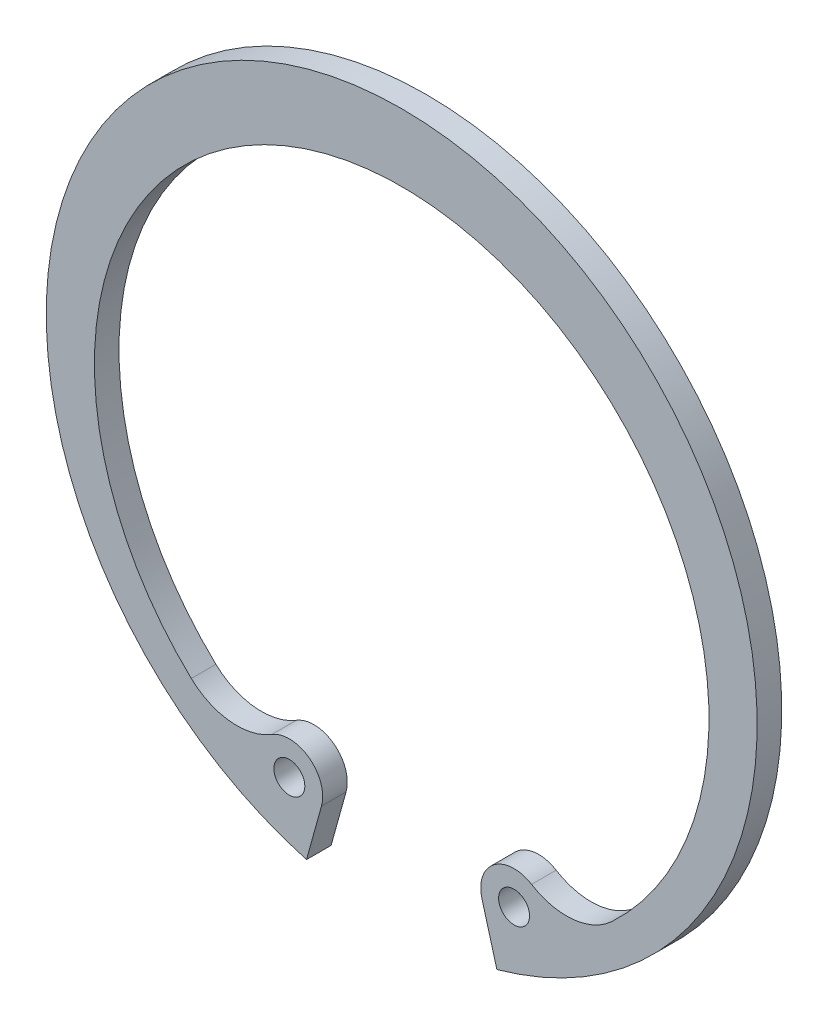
ISO-10303-21;
HEADER;
FILE_DESCRIPTION(('STEP AP214'),'2;1');
FILE_NAME('part.step','',(''),(''),'','','');
FILE_SCHEMA(('AUTOMOTIVE_DESIGN { 1 0 10303 214 1 1 1 1 }'));
ENDSEC;
DATA;
#1=APPLICATION_CONTEXT('core data for automotive mechanical design processes');
#2=APPLICATION_PROTOCOL_DEFINITION('international standard','automotive_design',2000,#1);
#3=PRODUCT_CONTEXT('',#1,'mechanical');
#4=PRODUCT('Part','Part','',(#3));
#5=PRODUCT_RELATED_PRODUCT_CATEGORY('part','',(#4));
#6=PRODUCT_DEFINITION_FORMATION('','',#4);
#7=PRODUCT_DEFINITION_CONTEXT('part definition',#1,'design');
#8=PRODUCT_DEFINITION('design','',#6,#7);
#9=PRODUCT_DEFINITION_SHAPE('','',#8);
#10=(LENGTH_UNIT() NAMED_UNIT(*) SI_UNIT(.MILLI.,.METRE.));
#11=(NAMED_UNIT(*) PLANE_ANGLE_UNIT() SI_UNIT($,.RADIAN.));
#12=(NAMED_UNIT(*) SI_UNIT($,.STERADIAN.) SOLID_ANGLE_UNIT());
#13=UNCERTAINTY_MEASURE_WITH_UNIT(LENGTH_MEASURE(1.E-05),#10,'distance_accuracy_value','');
#14=(GEOMETRIC_REPRESENTATION_CONTEXT(3) GLOBAL_UNCERTAINTY_ASSIGNED_CONTEXT((#13)) GLOBAL_UNIT_ASSIGNED_CONTEXT((#10,
#11,#12)) REPRESENTATION_CONTEXT('',''));
#15=CARTESIAN_POINT('',(0.,0.,0.));
#16=DIRECTION('',(0.,0.,1.));
#17=DIRECTION('',(1.,0.,0.));
#18=AXIS2_PLACEMENT_3D('',#15,#16,#17);
#19=CARTESIAN_POINT('',(0.,0.,-1.57480000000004));
#20=DIRECTION('',(0.,0.,1.));
#21=DIRECTION('',(1.,0.,0.));
#22=AXIS2_PLACEMENT_3D('',#19,#20,#21);
#23=CYLINDRICAL_SURFACE('',#22,22.7584);
#24=CARTESIAN_POINT('',(0.,0.,0.));
#25=DIRECTION('',(0.,0.,1.));
#26=DIRECTION('',(1.,0.,0.));
#27=AXIS2_PLACEMENT_3D('',#24,#25,#26);
#28=CIRCLE('',#27,22.7584);
#29=CARTESIAN_POINT('',(6.09456168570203,-21.9271769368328,0.));
#30=VERTEX_POINT('',#29);
#31=CARTESIAN_POINT('',(-6.09456168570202,-21.9271769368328,0.));
#32=VERTEX_POINT('',#31);
#33=EDGE_CURVE('E131',#30,#32,#28,.T.);
#34=ORIENTED_EDGE('',*,*,#33,.F.);
#35=DIRECTION('',(0.,0.,1.));
#36=VECTOR('',#35,1.);
#37=CARTESIAN_POINT('',(6.09456168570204,-21.9271769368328,-1.57480000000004));
#38=LINE('',#37,#36);
#39=CARTESIAN_POINT('',(6.09456168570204,-21.9271769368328,-1.57480000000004));
#40=VERTEX_POINT('',#39);
#41=EDGE_CURVE('E11',#40,#30,#38,.T.);
#42=ORIENTED_EDGE('',*,*,#41,.F.);
#43=CARTESIAN_POINT('',(0.,0.,-1.57480000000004));
#44=DIRECTION('',(0.,0.,1.));
#45=DIRECTION('',(1.,0.,0.));
#46=AXIS2_PLACEMENT_3D('',#43,#44,#45);
#47=CIRCLE('',#46,22.7584);
#48=CARTESIAN_POINT('',(-6.09456168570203,-21.9271769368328,-1.57480000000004));
#49=VERTEX_POINT('',#48);
#50=EDGE_CURVE('E152',#40,#49,#47,.T.);
#51=ORIENTED_EDGE('',*,*,#50,.T.);
#52=DIRECTION('',(0.,0.,1.));
#53=VECTOR('',#52,1.);
#54=CARTESIAN_POINT('',(-6.09456168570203,-21.9271769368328,-1.57480000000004));
#55=LINE('',#54,#53);
#56=EDGE_CURVE('E37',#49,#32,#55,.T.);
#57=ORIENTED_EDGE('',*,*,#56,.T.);
#58=EDGE_LOOP('',(#34,#42,#51,#57));
#59=FACE_BOUND('',#58,.T.);
#60=ADVANCED_FACE('F34',(#59),#23,.T.);
#61=CARTESIAN_POINT('',(6.09456168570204,-21.9271769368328,-1.57480000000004));
#62=DIRECTION('',(-0.963476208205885,-0.267793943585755,0.));
#63=DIRECTION('',(0.267793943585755,-0.963476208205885,0.));
#64=AXIS2_PLACEMENT_3D('',#61,#62,#63);
#65=PLANE('',#64);
#66=DIRECTION('',(0.267793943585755,-0.963476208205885,0.));
#67=VECTOR('',#66,1.);
#68=CARTESIAN_POINT('',(6.09456168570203,-21.9271769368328,0.));
#69=LINE('',#68,#67);
#70=CARTESIAN_POINT('',(5.1378218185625,-18.4849926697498,0.));
#71=VERTEX_POINT('',#70);
#72=EDGE_CURVE('E150',#71,#30,#69,.T.);
#73=ORIENTED_EDGE('',*,*,#72,.F.);
#74=DIRECTION('',(0.,0.,1.));
#75=VECTOR('',#74,1.);
#76=CARTESIAN_POINT('',(5.13782181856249,-18.4849926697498,-1.57480000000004));
#77=LINE('',#76,#75);
#78=CARTESIAN_POINT('',(5.13782181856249,-18.4849926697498,-1.57480000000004));
#79=VERTEX_POINT('',#78);
#80=EDGE_CURVE('E43',#79,#71,#77,.T.);
#81=ORIENTED_EDGE('',*,*,#80,.F.);
#82=DIRECTION('',(0.267793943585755,-0.963476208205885,0.));
#83=VECTOR('',#82,1.);
#84=CARTESIAN_POINT('',(6.09456168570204,-21.9271769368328,-1.57480000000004));
#85=LINE('',#84,#83);
#86=EDGE_CURVE('E121',#79,#40,#85,.T.);
#87=ORIENTED_EDGE('',*,*,#86,.T.);
#88=ORIENTED_EDGE('',*,*,#41,.T.);
#89=EDGE_LOOP('',(#73,#81,#87,#88));
#90=FACE_BOUND('',#89,.T.);
#91=ADVANCED_FACE('F164',(#90),#65,.T.);
#92=CARTESIAN_POINT('',(7.19349465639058,-17.9136275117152,-1.5748000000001));
#93=DIRECTION('',(0.,0.,1.));
#94=DIRECTION('',(1.,0.,0.));
#95=AXIS2_PLACEMENT_3D('',#92,#93,#94);
#96=CYLINDRICAL_SURFACE('',#95,2.1336);
#97=CARTESIAN_POINT('',(7.19349465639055,-17.9136275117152,0.));
#98=DIRECTION('',(0.,0.,1.));
#99=DIRECTION('',(1.,0.,0.));
#100=AXIS2_PLACEMENT_3D('',#97,#98,#99);
#101=CIRCLE('',#100,2.1336);
#102=CARTESIAN_POINT('',(8.31190613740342,-16.0966507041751,0.));
#103=VERTEX_POINT('',#102);
#104=EDGE_CURVE('E108',#103,#71,#101,.T.);
#105=ORIENTED_EDGE('',*,*,#104,.F.);
#106=DIRECTION('',(0.,0.,1.));
#107=VECTOR('',#106,1.);
#108=CARTESIAN_POINT('',(8.31190613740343,-16.0966507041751,-1.5748000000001));
#109=LINE('',#108,#107);
#110=CARTESIAN_POINT('',(8.31190613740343,-16.0966507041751,-1.5748000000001));
#111=VERTEX_POINT('',#110);
#112=EDGE_CURVE('E103',#111,#103,#109,.T.);
#113=ORIENTED_EDGE('',*,*,#112,.F.);
#114=CARTESIAN_POINT('',(7.19349465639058,-17.9136275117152,-1.5748000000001));
#115=DIRECTION('',(0.,0.,1.));
#116=DIRECTION('',(1.,0.,0.));
#117=AXIS2_PLACEMENT_3D('',#114,#115,#116);
#118=CIRCLE('',#117,2.1336);
#119=EDGE_CURVE('E106',#111,#79,#118,.T.);
#120=ORIENTED_EDGE('',*,*,#119,.T.);
#121=ORIENTED_EDGE('',*,*,#80,.T.);
#122=EDGE_LOOP('',(#105,#113,#120,#121));
#123=FACE_BOUND('',#122,.T.);
#124=ADVANCED_FACE('F105',(#123),#96,.T.);
#125=CARTESIAN_POINT('',(10.5487290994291,-12.4626970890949,-1.57480000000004));
#126=DIRECTION('',(0.,0.,1.));
#127=DIRECTION('',(1.,0.,0.));
#128=AXIS2_PLACEMENT_3D('',#125,#126,#127);
#129=CYLINDRICAL_SURFACE('',#128,4.26719999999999);
#130=CARTESIAN_POINT('',(10.5487290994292,-12.4626970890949,0.));
#131=DIRECTION('',(0.,0.,-1.));
#132=DIRECTION('',(1.,0.,0.));
#133=AXIS2_PLACEMENT_3D('',#130,#131,#132);
#134=CIRCLE('',#133,4.26719999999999);
#135=CARTESIAN_POINT('',(13.4704001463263,-15.572815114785,0.));
#136=VERTEX_POINT('',#135);
#137=EDGE_CURVE('E147',#136,#103,#134,.T.);
#138=ORIENTED_EDGE('',*,*,#137,.F.);
#139=DIRECTION('',(0.,0.,1.));
#140=VECTOR('',#139,1.);
#141=CARTESIAN_POINT('',(13.4704001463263,-15.5728151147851,-1.57480000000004));
#142=LINE('',#141,#140);
#143=CARTESIAN_POINT('',(13.4704001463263,-15.5728151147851,-1.57480000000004));
#144=VERTEX_POINT('',#143);
#145=EDGE_CURVE('E113',#144,#136,#142,.T.);
#146=ORIENTED_EDGE('',*,*,#145,.F.);
#147=CARTESIAN_POINT('',(10.5487290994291,-12.4626970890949,-1.57480000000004));
#148=DIRECTION('',(0.,0.,-1.));
#149=DIRECTION('',(1.,0.,0.));
#150=AXIS2_PLACEMENT_3D('',#147,#148,#149);
#151=CIRCLE('',#150,4.26719999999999);
#152=EDGE_CURVE('E119',#144,#111,#151,.T.);
#153=ORIENTED_EDGE('',*,*,#152,.T.);
#154=ORIENTED_EDGE('',*,*,#112,.T.);
#155=EDGE_LOOP('',(#138,#146,#153,#154));
#156=FACE_BOUND('',#155,.T.);
#157=ADVANCED_FACE('F123',(#156),#129,.F.);
#158=CARTESIAN_POINT('',(0.,-1.23357786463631,-1.57479999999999));
#159=DIRECTION('',(0.,0.,1.));
#160=DIRECTION('',(1.,0.,0.));
#161=AXIS2_PLACEMENT_3D('',#158,#159,#160);
#162=CYLINDRICAL_SURFACE('',#161,19.6739778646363);
#163=CARTESIAN_POINT('',(0.,-1.2335778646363,0.));
#164=DIRECTION('',(0.,0.,-1.));
#165=DIRECTION('',(1.,0.,0.));
#166=AXIS2_PLACEMENT_3D('',#163,#164,#165);
#167=CIRCLE('',#166,19.6739778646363);
#168=CARTESIAN_POINT('',(-13.4704001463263,-15.5728151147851,0.));
#169=VERTEX_POINT('',#168);
#170=EDGE_CURVE('E144',#169,#136,#167,.T.);
#171=ORIENTED_EDGE('',*,*,#170,.F.);
#172=DIRECTION('',(0.,0.,1.));
#173=VECTOR('',#172,1.);
#174=CARTESIAN_POINT('',(-13.4704001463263,-15.5728151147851,-1.57479999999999));
#175=LINE('',#174,#173);
#176=CARTESIAN_POINT('',(-13.4704001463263,-15.5728151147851,-1.57479999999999));
#177=VERTEX_POINT('',#176);
#178=EDGE_CURVE('E156',#177,#169,#175,.T.);
#179=ORIENTED_EDGE('',*,*,#178,.F.);
#180=CARTESIAN_POINT('',(0.,-1.23357786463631,-1.57479999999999));
#181=DIRECTION('',(0.,0.,-1.));
#182=DIRECTION('',(1.,0.,0.));
#183=AXIS2_PLACEMENT_3D('',#180,#181,#182);
#184=CIRCLE('',#183,19.6739778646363);
#185=EDGE_CURVE('E124',#177,#144,#184,.T.);
#186=ORIENTED_EDGE('',*,*,#185,.T.);
#187=ORIENTED_EDGE('',*,*,#145,.T.);
#188=EDGE_LOOP('',(#171,#179,#186,#187));
#189=FACE_BOUND('',#188,.T.);
#190=ADVANCED_FACE('F177',(#189),#162,.F.);
#191=CARTESIAN_POINT('',(-10.5487290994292,-12.4626970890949,-1.57480000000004));
#192=DIRECTION('',(0.,0.,1.));
#193=DIRECTION('',(1.,0.,0.));
#194=AXIS2_PLACEMENT_3D('',#191,#192,#193);
#195=CYLINDRICAL_SURFACE('',#194,4.2672);
#196=CARTESIAN_POINT('',(-10.5487290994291,-12.4626970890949,0.));
#197=DIRECTION('',(0.,0.,-1.));
#198=DIRECTION('',(1.,0.,0.));
#199=AXIS2_PLACEMENT_3D('',#196,#197,#198);
#200=CIRCLE('',#199,4.2672);
#201=CARTESIAN_POINT('',(-8.31190613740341,-16.0966507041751,-1.11022302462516E-13));
#202=VERTEX_POINT('',#201);
#203=EDGE_CURVE('E141',#202,#169,#200,.T.);
#204=ORIENTED_EDGE('',*,*,#203,.F.);
#205=DIRECTION('',(0.,0.,1.));
#206=VECTOR('',#205,1.);
#207=CARTESIAN_POINT('',(-8.31190613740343,-16.0966507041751,-1.57480000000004));
#208=LINE('',#207,#206);
#209=CARTESIAN_POINT('',(-8.31190613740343,-16.0966507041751,-1.57480000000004));
#210=VERTEX_POINT('',#209);
#211=EDGE_CURVE('E158',#210,#202,#208,.T.);
#212=ORIENTED_EDGE('',*,*,#211,.F.);
#213=CARTESIAN_POINT('',(-10.5487290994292,-12.4626970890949,-1.57480000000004));
#214=DIRECTION('',(0.,0.,-1.));
#215=DIRECTION('',(1.,0.,0.));
#216=AXIS2_PLACEMENT_3D('',#213,#214,#215);
#217=CIRCLE('',#216,4.2672);
#218=EDGE_CURVE('E126',#210,#177,#217,.T.);
#219=ORIENTED_EDGE('',*,*,#218,.T.);
#220=ORIENTED_EDGE('',*,*,#178,.T.);
#221=EDGE_LOOP('',(#204,#212,#219,#220));
#222=FACE_BOUND('',#221,.T.);
#223=ADVANCED_FACE('F180',(#222),#195,.F.);
#224=CARTESIAN_POINT('',(-7.19349465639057,-17.9136275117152,-1.57480000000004));
#225=DIRECTION('',(0.,0.,1.));
#226=DIRECTION('',(1.,0.,0.));
#227=AXIS2_PLACEMENT_3D('',#224,#225,#226);
#228=CYLINDRICAL_SURFACE('',#227,2.1336);
#229=CARTESIAN_POINT('',(-7.19349465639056,-17.9136275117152,0.));
#230=DIRECTION('',(0.,0.,1.));
#231=DIRECTION('',(1.,0.,0.));
#232=AXIS2_PLACEMENT_3D('',#229,#230,#231);
#233=CIRCLE('',#232,2.1336);
#234=CARTESIAN_POINT('',(-5.1378218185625,-18.4849926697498,0.));
#235=VERTEX_POINT('',#234);
#236=EDGE_CURVE('E138',#235,#202,#233,.T.);
#237=ORIENTED_EDGE('',*,*,#236,.F.);
#238=DIRECTION('',(0.,0.,1.));
#239=VECTOR('',#238,1.);
#240=CARTESIAN_POINT('',(-5.13782181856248,-18.4849926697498,-1.5748000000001));
#241=LINE('',#240,#239);
#242=CARTESIAN_POINT('',(-5.13782181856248,-18.4849926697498,-1.5748000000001));
#243=VERTEX_POINT('',#242);
#244=EDGE_CURVE('E159',#243,#235,#241,.T.);
#245=ORIENTED_EDGE('',*,*,#244,.F.);
#246=CARTESIAN_POINT('',(-7.19349465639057,-17.9136275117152,-1.57480000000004));
#247=DIRECTION('',(0.,0.,1.));
#248=DIRECTION('',(1.,0.,0.));
#249=AXIS2_PLACEMENT_3D('',#246,#247,#248);
#250=CIRCLE('',#249,2.1336);
#251=EDGE_CURVE('E226',#243,#210,#250,.T.);
#252=ORIENTED_EDGE('',*,*,#251,.T.);
#253=ORIENTED_EDGE('',*,*,#211,.T.);
#254=EDGE_LOOP('',(#237,#245,#252,#253));
#255=FACE_BOUND('',#254,.T.);
#256=ADVANCED_FACE('F184',(#255),#228,.T.);
#257=CARTESIAN_POINT('',(-6.09456168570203,-21.9271769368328,-1.57480000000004));
#258=DIRECTION('',(0.963476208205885,-0.267793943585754,0.));
#259=DIRECTION('',(0.267793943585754,0.963476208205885,0.));
#260=AXIS2_PLACEMENT_3D('',#257,#258,#259);
#261=PLANE('',#260);
#262=DIRECTION('',(0.267793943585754,0.963476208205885,0.));
#263=VECTOR('',#262,1.);
#264=CARTESIAN_POINT('',(-6.09456168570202,-21.9271769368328,0.));
#265=LINE('',#264,#263);
#266=EDGE_CURVE('E134',#32,#235,#265,.T.);
#267=ORIENTED_EDGE('',*,*,#266,.F.);
#268=ORIENTED_EDGE('',*,*,#56,.F.);
#269=DIRECTION('',(0.267793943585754,0.963476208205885,0.));
#270=VECTOR('',#269,1.);
#271=CARTESIAN_POINT('',(-6.09456168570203,-21.9271769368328,-1.57480000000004));
#272=LINE('',#271,#270);
#273=EDGE_CURVE('E224',#49,#243,#272,.T.);
#274=ORIENTED_EDGE('',*,*,#273,.T.);
#275=ORIENTED_EDGE('',*,*,#244,.T.);
#276=EDGE_LOOP('',(#267,#268,#274,#275));
#277=FACE_BOUND('',#276,.T.);
#278=ADVANCED_FACE('F161',(#277),#261,.T.);
#279=CARTESIAN_POINT('',(0.,0.,-1.57480000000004));
#280=DIRECTION('',(0.,0.,1.));
#281=DIRECTION('',(1.,0.,0.));
#282=AXIS2_PLACEMENT_3D('',#279,#280,#281);
#283=PLANE('',#282);
#284=CARTESIAN_POINT('',(-7.19349465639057,-17.9136275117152,-1.57480000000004));
#285=DIRECTION('',(0.,0.,1.));
#286=DIRECTION('',(1.,0.,0.));
#287=AXIS2_PLACEMENT_3D('',#284,#285,#286);
#288=CIRCLE('',#287,0.990599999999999);
#289=CARTESIAN_POINT('',(-6.20289465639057,-17.9136275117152,-1.57480000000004));
#290=VERTEX_POINT('',#289);
#291=EDGE_CURVE('E211',#290,#290,#288,.T.);
#292=ORIENTED_EDGE('',*,*,#291,.T.);
#293=EDGE_LOOP('',(#292));
#294=FACE_BOUND('',#293,.T.);
#295=CARTESIAN_POINT('',(7.19349465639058,-17.9136275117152,-1.5748000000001));
#296=DIRECTION('',(0.,0.,1.));
#297=DIRECTION('',(1.,0.,0.));
#298=AXIS2_PLACEMENT_3D('',#295,#296,#297);
#299=CIRCLE('',#298,0.990599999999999);
#300=CARTESIAN_POINT('',(8.18409465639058,-17.9136275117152,-1.5748000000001));
#301=VERTEX_POINT('',#300);
#302=EDGE_CURVE('E135',#301,#301,#299,.T.);
#303=ORIENTED_EDGE('',*,*,#302,.T.);
#304=EDGE_LOOP('',(#303));
#305=FACE_BOUND('',#304,.T.);
#306=ORIENTED_EDGE('',*,*,#50,.F.);
#307=ORIENTED_EDGE('',*,*,#86,.F.);
#308=ORIENTED_EDGE('',*,*,#119,.F.);
#309=ORIENTED_EDGE('',*,*,#152,.F.);
#310=ORIENTED_EDGE('',*,*,#185,.F.);
#311=ORIENTED_EDGE('',*,*,#218,.F.);
#312=ORIENTED_EDGE('',*,*,#251,.F.);
#313=ORIENTED_EDGE('',*,*,#273,.F.);
#314=EDGE_LOOP('',(#306,#307,#308,#309,#310,#311,#312,#313));
#315=FACE_BOUND('',#314,.T.);
#316=ADVANCED_FACE('F117',(#294,#305,#315),#283,.F.);
#317=CARTESIAN_POINT('',(0.,0.,0.));
#318=DIRECTION('',(0.,0.,1.));
#319=DIRECTION('',(1.,0.,0.));
#320=AXIS2_PLACEMENT_3D('',#317,#318,#319);
#321=PLANE('',#320);
#322=CARTESIAN_POINT('',(-7.19349465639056,-17.9136275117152,0.));
#323=DIRECTION('',(0.,0.,1.));
#324=DIRECTION('',(1.,0.,0.));
#325=AXIS2_PLACEMENT_3D('',#322,#323,#324);
#326=CIRCLE('',#325,0.990599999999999);
#327=CARTESIAN_POINT('',(-6.20289465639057,-17.9136275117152,0.));
#328=VERTEX_POINT('',#327);
#329=EDGE_CURVE('E214',#328,#328,#326,.T.);
#330=ORIENTED_EDGE('',*,*,#329,.F.);
#331=EDGE_LOOP('',(#330));
#332=FACE_BOUND('',#331,.T.);
#333=CARTESIAN_POINT('',(7.19349465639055,-17.9136275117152,0.));
#334=DIRECTION('',(0.,0.,1.));
#335=DIRECTION('',(1.,0.,0.));
#336=AXIS2_PLACEMENT_3D('',#333,#334,#335);
#337=CIRCLE('',#336,0.990599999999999);
#338=CARTESIAN_POINT('',(8.18409465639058,-17.9136275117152,0.));
#339=VERTEX_POINT('',#338);
#340=EDGE_CURVE('E216',#339,#339,#337,.T.);
#341=ORIENTED_EDGE('',*,*,#340,.F.);
#342=EDGE_LOOP('',(#341));
#343=FACE_BOUND('',#342,.T.);
#344=ORIENTED_EDGE('',*,*,#33,.T.);
#345=ORIENTED_EDGE('',*,*,#266,.T.);
#346=ORIENTED_EDGE('',*,*,#236,.T.);
#347=ORIENTED_EDGE('',*,*,#203,.T.);
#348=ORIENTED_EDGE('',*,*,#170,.T.);
#349=ORIENTED_EDGE('',*,*,#137,.T.);
#350=ORIENTED_EDGE('',*,*,#104,.T.);
#351=ORIENTED_EDGE('',*,*,#72,.T.);
#352=EDGE_LOOP('',(#344,#345,#346,#347,#348,#349,#350,#351));
#353=FACE_BOUND('',#352,.T.);
#354=ADVANCED_FACE('F163',(#332,#343,#353),#321,.T.);
#355=CARTESIAN_POINT('',(7.19349465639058,-17.9136275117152,-1.5748000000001));
#356=DIRECTION('',(0.,0.,1.));
#357=DIRECTION('',(1.,0.,0.));
#358=AXIS2_PLACEMENT_3D('',#355,#356,#357);
#359=CYLINDRICAL_SURFACE('',#358,0.990599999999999);
#360=CARTESIAN_POINT('',(8.18409465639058,-17.9136275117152,-1.5748000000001));
#361=CARTESIAN_POINT('',(8.18409465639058,-17.9136275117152,-1.55839583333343));
#362=CARTESIAN_POINT('',(8.18409465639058,-17.9136275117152,-1.54199166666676));
#363=CARTESIAN_POINT('',(8.18409465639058,-17.9136275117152,-1.50918333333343));
#364=CARTESIAN_POINT('',(8.18409465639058,-17.9136275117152,-1.49277916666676));
#365=CARTESIAN_POINT('',(8.18409465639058,-17.9136275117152,-1.45997083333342));
#366=CARTESIAN_POINT('',(8.18409465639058,-17.9136275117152,-1.44356666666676));
#367=CARTESIAN_POINT('',(8.18409465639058,-17.9136275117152,-1.41075833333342));
#368=CARTESIAN_POINT('',(8.18409465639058,-17.9136275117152,-1.39435416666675));
#369=CARTESIAN_POINT('',(8.18409465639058,-17.9136275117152,-1.36154583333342));
#370=CARTESIAN_POINT('',(8.18409465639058,-17.9136275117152,-1.34514166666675));
#371=CARTESIAN_POINT('',(8.18409465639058,-17.9136275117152,-1.31233333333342));
#372=CARTESIAN_POINT('',(8.18409465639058,-17.9136275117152,-1.29592916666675));
#373=CARTESIAN_POINT('',(8.18409465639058,-17.9136275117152,-1.26312083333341));
#374=CARTESIAN_POINT('',(8.18409465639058,-17.9136275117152,-1.24671666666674));
#375=CARTESIAN_POINT('',(8.18409465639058,-17.9136275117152,-1.21390833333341));
#376=CARTESIAN_POINT('',(8.18409465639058,-17.9136275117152,-1.19750416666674));
#377=CARTESIAN_POINT('',(8.18409465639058,-17.9136275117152,-1.16469583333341));
#378=CARTESIAN_POINT('',(8.18409465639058,-17.9136275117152,-1.14829166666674));
#379=CARTESIAN_POINT('',(8.18409465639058,-17.9136275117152,-1.1154833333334));
#380=CARTESIAN_POINT('',(8.18409465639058,-17.9136275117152,-1.09907916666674));
#381=CARTESIAN_POINT('',(8.18409465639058,-17.9136275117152,-1.0662708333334));
#382=CARTESIAN_POINT('',(8.18409465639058,-17.9136275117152,-1.04986666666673));
#383=CARTESIAN_POINT('',(8.18409465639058,-17.9136275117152,-1.0170583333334));
#384=CARTESIAN_POINT('',(8.18409465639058,-17.9136275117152,-1.00065416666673));
#385=CARTESIAN_POINT('',(8.18409465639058,-17.9136275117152,-0.967845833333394));
#386=CARTESIAN_POINT('',(8.18409465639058,-17.9136275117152,-0.951441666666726));
#387=CARTESIAN_POINT('',(8.18409465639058,-17.9136275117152,-0.91863333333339));
#388=CARTESIAN_POINT('',(8.18409465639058,-17.9136275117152,-0.902229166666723));
#389=CARTESIAN_POINT('',(8.18409465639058,-17.9136275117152,-0.869420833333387));
#390=CARTESIAN_POINT('',(8.18409465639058,-17.9136275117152,-0.85301666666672));
#391=CARTESIAN_POINT('',(8.18409465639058,-17.9136275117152,-0.820208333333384));
#392=CARTESIAN_POINT('',(8.18409465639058,-17.9136275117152,-0.803804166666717));
#393=CARTESIAN_POINT('',(8.18409465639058,-17.9136275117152,-0.770995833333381));
#394=CARTESIAN_POINT('',(8.18409465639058,-17.9136275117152,-0.754591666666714));
#395=CARTESIAN_POINT('',(8.18409465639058,-17.9136275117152,-0.721783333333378));
#396=CARTESIAN_POINT('',(8.18409465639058,-17.9136275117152,-0.705379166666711));
#397=CARTESIAN_POINT('',(8.18409465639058,-17.9136275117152,-0.672570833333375));
#398=CARTESIAN_POINT('',(8.18409465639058,-17.9136275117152,-0.656166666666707));
#399=CARTESIAN_POINT('',(8.18409465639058,-17.9136275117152,-0.623358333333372));
#400=CARTESIAN_POINT('',(8.18409465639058,-17.9136275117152,-0.606954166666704));
#401=CARTESIAN_POINT('',(8.18409465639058,-17.9136275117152,-0.574145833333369));
#402=CARTESIAN_POINT('',(8.18409465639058,-17.9136275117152,-0.557741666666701));
#403=CARTESIAN_POINT('',(8.18409465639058,-17.9136275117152,-0.524933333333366));
#404=CARTESIAN_POINT('',(8.18409465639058,-17.9136275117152,-0.508529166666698));
#405=CARTESIAN_POINT('',(8.18409465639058,-17.9136275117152,-0.475720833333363));
#406=CARTESIAN_POINT('',(8.18409465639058,-17.9136275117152,-0.459316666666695));
#407=CARTESIAN_POINT('',(8.18409465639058,-17.9136275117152,-0.42650833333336));
#408=CARTESIAN_POINT('',(8.18409465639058,-17.9136275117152,-0.410104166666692));
#409=CARTESIAN_POINT('',(8.18409465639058,-17.9136275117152,-0.377295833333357));
#410=CARTESIAN_POINT('',(8.18409465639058,-17.9136275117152,-0.360891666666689));
#411=CARTESIAN_POINT('',(8.18409465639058,-17.9136275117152,-0.328083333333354));
#412=CARTESIAN_POINT('',(8.18409465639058,-17.9136275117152,-0.311679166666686));
#413=CARTESIAN_POINT('',(8.18409465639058,-17.9136275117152,-0.278870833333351));
#414=CARTESIAN_POINT('',(8.18409465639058,-17.9136275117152,-0.262466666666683));
#415=CARTESIAN_POINT('',(8.18409465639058,-17.9136275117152,-0.229658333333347));
#416=CARTESIAN_POINT('',(8.18409465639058,-17.9136275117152,-0.21325416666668));
#417=CARTESIAN_POINT('',(8.18409465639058,-17.9136275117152,-0.180445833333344));
#418=CARTESIAN_POINT('',(8.18409465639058,-17.9136275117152,-0.164041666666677));
#419=CARTESIAN_POINT('',(8.18409465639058,-17.9136275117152,-0.131233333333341));
#420=CARTESIAN_POINT('',(8.18409465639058,-17.9136275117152,-0.114829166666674));
#421=CARTESIAN_POINT('',(8.18409465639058,-17.9136275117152,-0.0820208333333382));
#422=CARTESIAN_POINT('',(8.18409465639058,-17.9136275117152,-0.0656166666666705));
#423=CARTESIAN_POINT('',(8.18409465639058,-17.9136275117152,-0.0328083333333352));
#424=CARTESIAN_POINT('',(8.18409465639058,-17.9136275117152,-0.0164041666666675));
#425=CARTESIAN_POINT('',(8.18409465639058,-17.9136275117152,0.));
#426=B_SPLINE_CURVE_WITH_KNOTS('',3,(#360,#361,#362,#363,#364,#365,#366,#367,#368,#369,#370,
#371,#372,#373,#374,#375,#376,#377,#378,#379,#380,#381,#382,#383,#384,#385,#386,#387,#388,#389,
#390,#391,#392,#393,#394,#395,#396,#397,#398,#399,#400,#401,#402,#403,#404,#405,#406,#407,#408,
#409,#410,#411,#412,#413,#414,#415,#416,#417,#418,#419,#420,#421,#422,#423,#424,#425),
.UNSPECIFIED.,.F.,.F.,(4,2,2,2,2,2,2,2,2,2,2,2,2,2,2,2,2,2,2,2,2,2,2,2,2,2,2,2,2,2,2,2,4),(0.,
0.0492125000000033,0.0984250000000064,0.147637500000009,0.196850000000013,0.246062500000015,
0.295275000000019,0.344487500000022,0.393700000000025,0.442912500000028,0.492125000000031,
0.541337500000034,0.590550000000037,0.63976250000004,0.688975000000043,0.738187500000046,
0.787400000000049,0.836612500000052,0.885825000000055,0.935037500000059,0.984250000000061,
1.03346250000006,1.08267500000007,1.13188750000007,1.18110000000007,1.23031250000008,
1.27952500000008,1.32873750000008,1.37795000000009,1.42716250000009,1.47637500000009,
1.5255875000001,1.5748000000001),.UNSPECIFIED.);
#427=EDGE_CURVE('BSEAM196',#301,#339,#426,.T.);
#428=ORIENTED_EDGE('',*,*,#302,.F.);
#429=ORIENTED_EDGE('',*,*,#340,.T.);
#430=ORIENTED_EDGE('',*,*,#427,.T.);
#431=ORIENTED_EDGE('',*,*,#427,.F.);
#432=EDGE_LOOP('',(#428,#430,#429,#431));
#433=FACE_BOUND('',#432,.T.);
#434=ADVANCED_FACE('F196',(#433),#359,.F.);
#435=CARTESIAN_POINT('',(-7.19349465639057,-17.9136275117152,-1.57480000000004));
#436=DIRECTION('',(0.,0.,1.));
#437=DIRECTION('',(1.,0.,0.));
#438=AXIS2_PLACEMENT_3D('',#435,#436,#437);
#439=CYLINDRICAL_SURFACE('',#438,0.990599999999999);
#440=CARTESIAN_POINT('',(-6.20289465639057,-17.9136275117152,-1.57480000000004));
#441=CARTESIAN_POINT('',(-6.20289465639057,-17.9136275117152,-1.55839583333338));
#442=CARTESIAN_POINT('',(-6.20289465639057,-17.9136275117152,-1.54199166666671));
#443=CARTESIAN_POINT('',(-6.20289465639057,-17.9136275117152,-1.50918333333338));
#444=CARTESIAN_POINT('',(-6.20289465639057,-17.9136275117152,-1.49277916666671));
#445=CARTESIAN_POINT('',(-6.20289465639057,-17.9136275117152,-1.45997083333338));
#446=CARTESIAN_POINT('',(-6.20289465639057,-17.9136275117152,-1.44356666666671));
#447=CARTESIAN_POINT('',(-6.20289465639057,-17.9136275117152,-1.41075833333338));
#448=CARTESIAN_POINT('',(-6.20289465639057,-17.9136275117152,-1.39435416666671));
#449=CARTESIAN_POINT('',(-6.20289465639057,-17.9136275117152,-1.36154583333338));
#450=CARTESIAN_POINT('',(-6.20289465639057,-17.9136275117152,-1.34514166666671));
#451=CARTESIAN_POINT('',(-6.20289465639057,-17.9136275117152,-1.31233333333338));
#452=CARTESIAN_POINT('',(-6.20289465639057,-17.9136275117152,-1.29592916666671));
#453=CARTESIAN_POINT('',(-6.20289465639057,-17.9136275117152,-1.26312083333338));
#454=CARTESIAN_POINT('',(-6.20289465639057,-17.9136275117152,-1.24671666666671));
#455=CARTESIAN_POINT('',(-6.20289465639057,-17.9136275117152,-1.21390833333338));
#456=CARTESIAN_POINT('',(-6.20289465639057,-17.9136275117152,-1.19750416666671));
#457=CARTESIAN_POINT('',(-6.20289465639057,-17.9136275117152,-1.16469583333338));
#458=CARTESIAN_POINT('',(-6.20289465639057,-17.9136275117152,-1.14829166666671));
#459=CARTESIAN_POINT('',(-6.20289465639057,-17.9136275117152,-1.11548333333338));
#460=CARTESIAN_POINT('',(-6.20289465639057,-17.9136275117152,-1.09907916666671));
#461=CARTESIAN_POINT('',(-6.20289465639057,-17.9136275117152,-1.06627083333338));
#462=CARTESIAN_POINT('',(-6.20289465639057,-17.9136275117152,-1.04986666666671));
#463=CARTESIAN_POINT('',(-6.20289465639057,-17.9136275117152,-1.01705833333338));
#464=CARTESIAN_POINT('',(-6.20289465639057,-17.9136275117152,-1.00065416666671));
#465=CARTESIAN_POINT('',(-6.20289465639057,-17.9136275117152,-0.967845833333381));
#466=CARTESIAN_POINT('',(-6.20289465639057,-17.9136275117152,-0.951441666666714));
#467=CARTESIAN_POINT('',(-6.20289465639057,-17.9136275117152,-0.918633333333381));
#468=CARTESIAN_POINT('',(-6.20289465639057,-17.9136275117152,-0.902229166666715));
#469=CARTESIAN_POINT('',(-6.20289465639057,-17.9136275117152,-0.869420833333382));
#470=CARTESIAN_POINT('',(-6.20289465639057,-17.9136275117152,-0.853016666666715));
#471=CARTESIAN_POINT('',(-6.20289465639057,-17.9136275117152,-0.820208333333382));
#472=CARTESIAN_POINT('',(-6.20289465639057,-17.9136275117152,-0.803804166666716));
#473=CARTESIAN_POINT('',(-6.20289465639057,-17.9136275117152,-0.770995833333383));
#474=CARTESIAN_POINT('',(-6.20289465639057,-17.9136275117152,-0.754591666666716));
#475=CARTESIAN_POINT('',(-6.20289465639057,-17.9136275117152,-0.721783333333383));
#476=CARTESIAN_POINT('',(-6.20289465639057,-17.9136275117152,-0.705379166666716));
#477=CARTESIAN_POINT('',(-6.20289465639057,-17.9136275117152,-0.672570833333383));
#478=CARTESIAN_POINT('',(-6.20289465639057,-17.9136275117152,-0.656166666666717));
#479=CARTESIAN_POINT('',(-6.20289465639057,-17.9136275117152,-0.623358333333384));
#480=CARTESIAN_POINT('',(-6.20289465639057,-17.9136275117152,-0.606954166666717));
#481=CARTESIAN_POINT('',(-6.20289465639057,-17.9136275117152,-0.574145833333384));
#482=CARTESIAN_POINT('',(-6.20289465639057,-17.9136275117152,-0.557741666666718));
#483=CARTESIAN_POINT('',(-6.20289465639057,-17.9136275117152,-0.524933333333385));
#484=CARTESIAN_POINT('',(-6.20289465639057,-17.9136275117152,-0.508529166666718));
#485=CARTESIAN_POINT('',(-6.20289465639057,-17.9136275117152,-0.475720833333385));
#486=CARTESIAN_POINT('',(-6.20289465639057,-17.9136275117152,-0.459316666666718));
#487=CARTESIAN_POINT('',(-6.20289465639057,-17.9136275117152,-0.426508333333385));
#488=CARTESIAN_POINT('',(-6.20289465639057,-17.9136275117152,-0.410104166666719));
#489=CARTESIAN_POINT('',(-6.20289465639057,-17.9136275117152,-0.377295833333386));
#490=CARTESIAN_POINT('',(-6.20289465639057,-17.9136275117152,-0.360891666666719));
#491=CARTESIAN_POINT('',(-6.20289465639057,-17.9136275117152,-0.328083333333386));
#492=CARTESIAN_POINT('',(-6.20289465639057,-17.9136275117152,-0.311679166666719));
#493=CARTESIAN_POINT('',(-6.20289465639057,-17.9136275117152,-0.278870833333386));
#494=CARTESIAN_POINT('',(-6.20289465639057,-17.9136275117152,-0.26246666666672));
#495=CARTESIAN_POINT('',(-6.20289465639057,-17.9136275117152,-0.229658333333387));
#496=CARTESIAN_POINT('',(-6.20289465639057,-17.9136275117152,-0.21325416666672));
#497=CARTESIAN_POINT('',(-6.20289465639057,-17.9136275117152,-0.180445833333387));
#498=CARTESIAN_POINT('',(-6.20289465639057,-17.9136275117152,-0.164041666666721));
#499=CARTESIAN_POINT('',(-6.20289465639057,-17.9136275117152,-0.131233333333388));
#500=CARTESIAN_POINT('',(-6.20289465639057,-17.9136275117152,-0.114829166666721));
#501=CARTESIAN_POINT('',(-6.20289465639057,-17.9136275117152,-0.082020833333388));
#502=CARTESIAN_POINT('',(-6.20289465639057,-17.9136275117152,-0.0656166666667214));
#503=CARTESIAN_POINT('',(-6.20289465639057,-17.9136275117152,-0.0328083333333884));
#504=CARTESIAN_POINT('',(-6.20289465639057,-17.9136275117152,-0.0164041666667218));
#505=CARTESIAN_POINT('',(-6.20289465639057,-17.9136275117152,0.));
#506=B_SPLINE_CURVE_WITH_KNOTS('',3,(#440,#441,#442,#443,#444,#445,#446,#447,#448,#449,#450,
#451,#452,#453,#454,#455,#456,#457,#458,#459,#460,#461,#462,#463,#464,#465,#466,#467,#468,#469,
#470,#471,#472,#473,#474,#475,#476,#477,#478,#479,#480,#481,#482,#483,#484,#485,#486,#487,#488,
#489,#490,#491,#492,#493,#494,#495,#496,#497,#498,#499,#500,#501,#502,#503,#504,#505),
.UNSPECIFIED.,.F.,.F.,(4,2,2,2,2,2,2,2,2,2,2,2,2,2,2,2,2,2,2,2,2,2,2,2,2,2,2,2,2,2,2,2,4),(0.,
0.0492124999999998,0.0984249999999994,0.147637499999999,0.196849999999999,0.246062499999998,
0.295274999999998,0.344487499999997,0.393699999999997,0.442912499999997,0.492124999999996,
0.541337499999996,0.590549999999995,0.639762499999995,0.688974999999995,0.738187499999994,
0.787399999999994,0.836612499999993,0.885824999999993,0.935037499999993,0.984249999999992,
1.03346249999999,1.08267499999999,1.13188749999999,1.18109999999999,1.23031249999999,
1.27952499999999,1.32873749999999,1.37794999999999,1.42716249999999,1.47637499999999,
1.52558749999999,1.57479999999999),.UNSPECIFIED.);
#507=EDGE_CURVE('BSEAM203',#290,#328,#506,.T.);
#508=ORIENTED_EDGE('',*,*,#291,.F.);
#509=ORIENTED_EDGE('',*,*,#329,.T.);
#510=ORIENTED_EDGE('',*,*,#507,.T.);
#511=ORIENTED_EDGE('',*,*,#507,.F.);
#512=EDGE_LOOP('',(#508,#510,#509,#511));
#513=FACE_BOUND('',#512,.T.);
#514=ADVANCED_FACE('F203',(#513),#439,.F.);
#515=CLOSED_SHELL('',(#60,#91,#124,#157,#190,#223,#256,#278,#316,#354,#434,#514));
#516=MANIFOLD_SOLID_BREP('B2',#515);
#517=ADVANCED_BREP_SHAPE_REPRESENTATION('',(#18,#516),#14);
#518=SHAPE_DEFINITION_REPRESENTATION(#9,#517);
ENDSEC;
END-ISO-10303-21;
